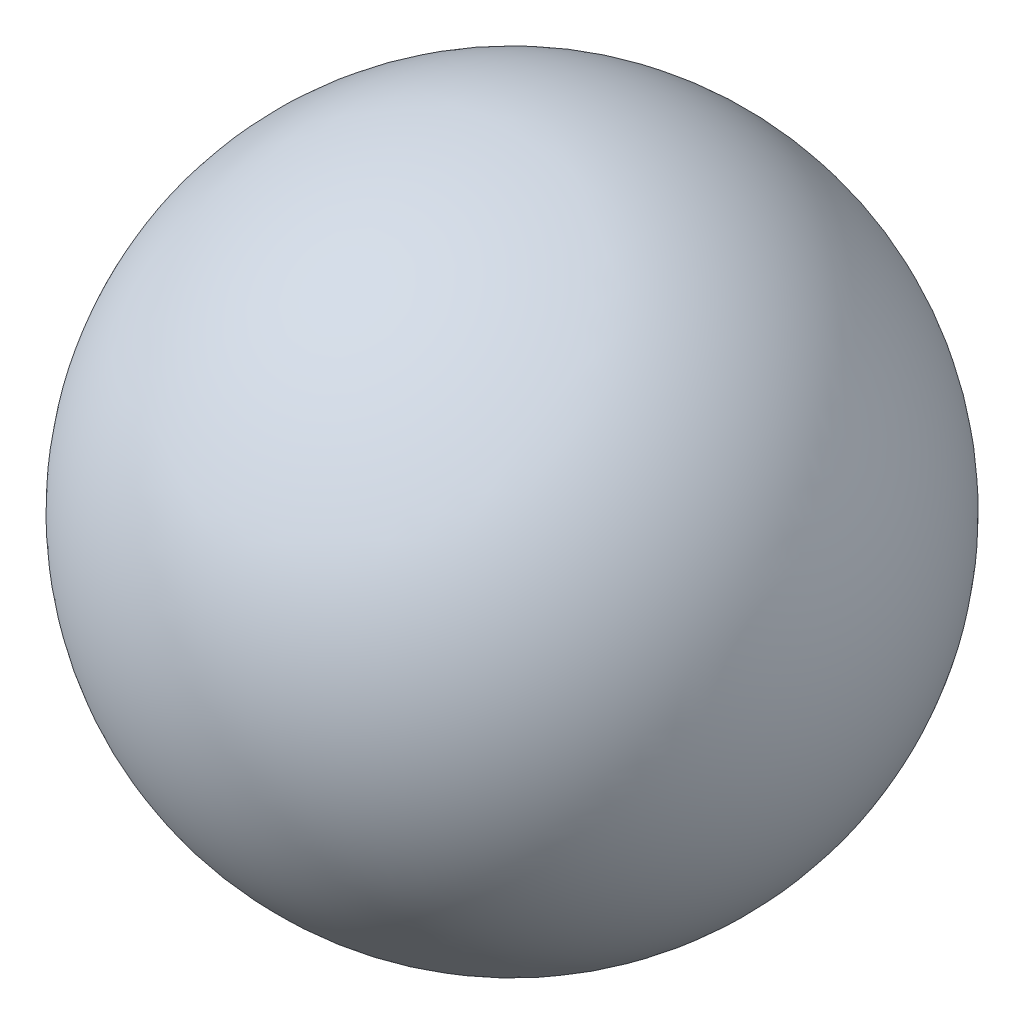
ISO-10303-21;
HEADER;
FILE_DESCRIPTION(('STEP AP214'),'2;1');
FILE_NAME('part.step','',(''),(''),'','','');
FILE_SCHEMA(('AUTOMOTIVE_DESIGN { 1 0 10303 214 1 1 1 1 }'));
ENDSEC;
DATA;
#1=APPLICATION_CONTEXT('core data for automotive mechanical design processes');
#2=APPLICATION_PROTOCOL_DEFINITION('international standard','automotive_design',2000,#1);
#3=PRODUCT_CONTEXT('',#1,'mechanical');
#4=PRODUCT('Part','Part','',(#3));
#5=PRODUCT_RELATED_PRODUCT_CATEGORY('part','',(#4));
#6=PRODUCT_DEFINITION_FORMATION('','',#4);
#7=PRODUCT_DEFINITION_CONTEXT('part definition',#1,'design');
#8=PRODUCT_DEFINITION('design','',#6,#7);
#9=PRODUCT_DEFINITION_SHAPE('','',#8);
#10=(LENGTH_UNIT() NAMED_UNIT(*) SI_UNIT(.MILLI.,.METRE.));
#11=(NAMED_UNIT(*) PLANE_ANGLE_UNIT() SI_UNIT($,.RADIAN.));
#12=(NAMED_UNIT(*) SI_UNIT($,.STERADIAN.) SOLID_ANGLE_UNIT());
#13=UNCERTAINTY_MEASURE_WITH_UNIT(LENGTH_MEASURE(1.E-05),#10,'distance_accuracy_value','');
#14=(GEOMETRIC_REPRESENTATION_CONTEXT(3) GLOBAL_UNCERTAINTY_ASSIGNED_CONTEXT((#13)) GLOBAL_UNIT_ASSIGNED_CONTEXT((#10,
#11,#12)) REPRESENTATION_CONTEXT('',''));
#15=CARTESIAN_POINT('',(0.,0.,0.));
#16=DIRECTION('',(0.,0.,1.));
#17=DIRECTION('',(1.,0.,0.));
#18=AXIS2_PLACEMENT_3D('',#15,#16,#17);
#19=CARTESIAN_POINT('',(4.,10.5,0.));
#20=DIRECTION('',(1.,0.,0.));
#21=DIRECTION('',(0.,1.,0.));
#22=AXIS2_PLACEMENT_3D('',#19,#20,#21);
#23=SPHERICAL_SURFACE('',#22,2.7);
#24=CARTESIAN_POINT('',(6.7,10.5,0.));
#25=VERTEX_POINT('',#24);
#26=VERTEX_LOOP('',#25);
#27=FACE_BOUND('',#26,.T.);
#28=ADVANCED_FACE('F27',(#27),#23,.T.);
#29=CLOSED_SHELL('',(#28));
#30=MANIFOLD_SOLID_BREP('B2',#29);
#31=ADVANCED_BREP_SHAPE_REPRESENTATION('',(#18,#30),#14);
#32=SHAPE_DEFINITION_REPRESENTATION(#9,#31);
ENDSEC;
END-ISO-10303-21;
